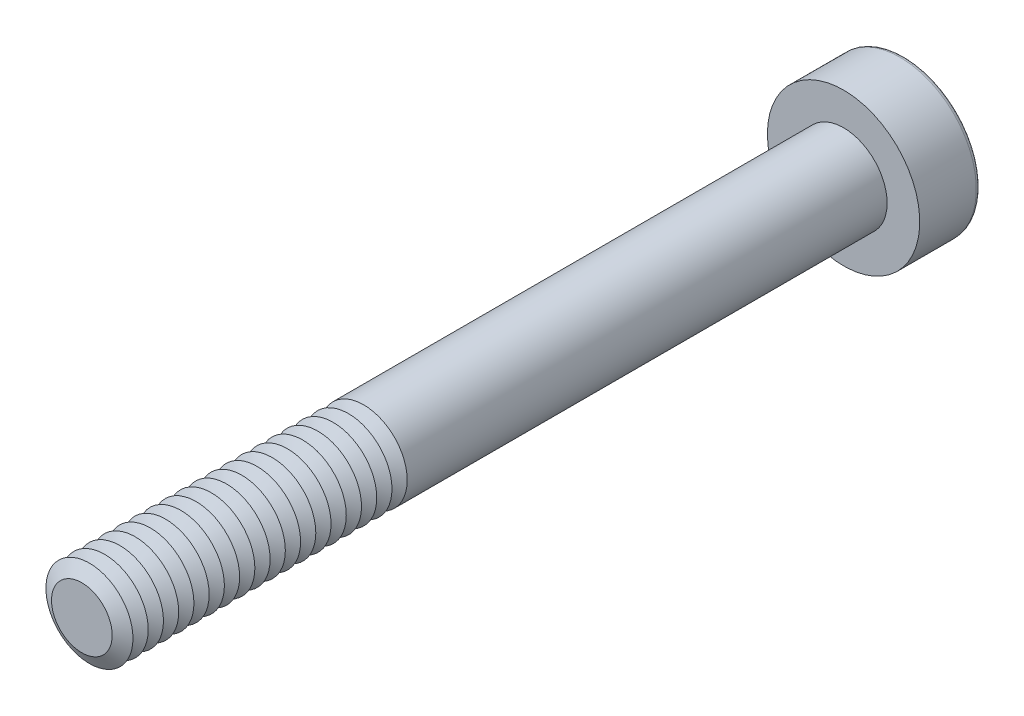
ISO-10303-21;
HEADER;
FILE_DESCRIPTION(('STEP AP214'),'2;1');
FILE_NAME('part.step','',(''),(''),'','','');
FILE_SCHEMA(('AUTOMOTIVE_DESIGN { 1 0 10303 214 1 1 1 1 }'));
ENDSEC;
DATA;
#1=APPLICATION_CONTEXT('core data for automotive mechanical design processes');
#2=APPLICATION_PROTOCOL_DEFINITION('international standard','automotive_design',2000,#1);
#3=PRODUCT_CONTEXT('',#1,'mechanical');
#4=PRODUCT('Part','Part','',(#3));
#5=PRODUCT_RELATED_PRODUCT_CATEGORY('part','',(#4));
#6=PRODUCT_DEFINITION_FORMATION('','',#4);
#7=PRODUCT_DEFINITION_CONTEXT('part definition',#1,'design');
#8=PRODUCT_DEFINITION('design','',#6,#7);
#9=PRODUCT_DEFINITION_SHAPE('','',#8);
#10=(LENGTH_UNIT() NAMED_UNIT(*) SI_UNIT(.MILLI.,.METRE.));
#11=(NAMED_UNIT(*) PLANE_ANGLE_UNIT() SI_UNIT($,.RADIAN.));
#12=(NAMED_UNIT(*) SI_UNIT($,.STERADIAN.) SOLID_ANGLE_UNIT());
#13=UNCERTAINTY_MEASURE_WITH_UNIT(LENGTH_MEASURE(1.E-05),#10,'distance_accuracy_value','');
#14=(GEOMETRIC_REPRESENTATION_CONTEXT(3) GLOBAL_UNCERTAINTY_ASSIGNED_CONTEXT((#13)) GLOBAL_UNIT_ASSIGNED_CONTEXT((#10,
#11,#12)) REPRESENTATION_CONTEXT('',''));
#15=CARTESIAN_POINT('',(0.,0.,0.));
#16=DIRECTION('',(0.,0.,1.));
#17=DIRECTION('',(1.,0.,0.));
#18=AXIS2_PLACEMENT_3D('',#15,#16,#17);
#19=CARTESIAN_POINT('',(0.,0.,32.55));
#20=DIRECTION('',(0.,0.,1.));
#21=DIRECTION('',(1.,0.,0.));
#22=AXIS2_PLACEMENT_3D('',#19,#20,#21);
#23=CONICAL_SURFACE('',#22,2.,1.04719755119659);
#24=CARTESIAN_POINT('',(0.,0.,32.2));
#25=DIRECTION('',(0.,0.,1.));
#26=DIRECTION('',(1.,0.,0.));
#27=AXIS2_PLACEMENT_3D('',#24,#25,#26);
#28=CIRCLE('',#27,1.39378221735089);
#29=CARTESIAN_POINT('',(1.39378221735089,0.,32.2));
#30=VERTEX_POINT('',#29);
#31=EDGE_CURVE('E313',#30,#30,#28,.T.);
#32=ORIENTED_EDGE('',*,*,#31,.T.);
#33=EDGE_LOOP('',(#32));
#34=FACE_BOUND('',#33,.T.);
#35=CARTESIAN_POINT('',(0.,0.,32.55));
#36=DIRECTION('',(0.,0.,1.));
#37=DIRECTION('',(1.,0.,0.));
#38=AXIS2_PLACEMENT_3D('',#35,#36,#37);
#39=CIRCLE('',#38,2.);
#40=CARTESIAN_POINT('',(2.,0.,32.55));
#41=VERTEX_POINT('',#40);
#42=EDGE_CURVE('E316',#41,#41,#39,.T.);
#43=ORIENTED_EDGE('',*,*,#42,.F.);
#44=EDGE_LOOP('',(#43));
#45=FACE_BOUND('',#44,.T.);
#46=ADVANCED_FACE('F39',(#34,#45),#23,.T.);
#47=CARTESIAN_POINT('',(0.,0.,32.2));
#48=DIRECTION('',(0.,0.,-1.));
#49=DIRECTION('',(-1.,0.,0.));
#50=AXIS2_PLACEMENT_3D('',#47,#48,#49);
#51=CONICAL_SURFACE('',#50,1.39378221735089,1.04719755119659);
#52=CARTESIAN_POINT('',(0.,0.,31.85));
#53=DIRECTION('',(0.,0.,1.));
#54=DIRECTION('',(1.,0.,0.));
#55=AXIS2_PLACEMENT_3D('',#52,#53,#54);
#56=CIRCLE('',#55,2.);
#57=CARTESIAN_POINT('',(2.,0.,31.85));
#58=VERTEX_POINT('',#57);
#59=EDGE_CURVE('E324',#58,#58,#56,.T.);
#60=ORIENTED_EDGE('',*,*,#59,.T.);
#61=EDGE_LOOP('',(#60));
#62=FACE_BOUND('',#61,.T.);
#63=ORIENTED_EDGE('',*,*,#31,.F.);
#64=EDGE_LOOP('',(#63));
#65=FACE_BOUND('',#64,.T.);
#66=ADVANCED_FACE('F245',(#62,#65),#51,.T.);
#67=CARTESIAN_POINT('',(0.,0.,35.));
#68=DIRECTION('',(0.,0.,1.));
#69=DIRECTION('',(1.,0.,0.));
#70=AXIS2_PLACEMENT_3D('',#67,#68,#69);
#71=PLANE('',#70);
#72=CARTESIAN_POINT('',(0.,0.,35.));
#73=DIRECTION('',(0.,0.,1.));
#74=DIRECTION('',(1.,0.,0.));
#75=AXIS2_PLACEMENT_3D('',#72,#73,#74);
#76=CIRCLE('',#75,1.39378221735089);
#77=CARTESIAN_POINT('',(1.39378221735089,0.,35.));
#78=VERTEX_POINT('',#77);
#79=EDGE_CURVE('E174',#78,#78,#76,.T.);
#80=ORIENTED_EDGE('',*,*,#79,.T.);
#81=EDGE_LOOP('',(#80));
#82=FACE_BOUND('',#81,.T.);
#83=ADVANCED_FACE('F251',(#82),#71,.T.);
#84=CARTESIAN_POINT('',(0.,0.,35.));
#85=DIRECTION('',(0.,0.,-1.));
#86=DIRECTION('',(-1.,0.,0.));
#87=AXIS2_PLACEMENT_3D('',#84,#85,#86);
#88=CONICAL_SURFACE('',#87,1.39378221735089,1.04719755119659);
#89=CARTESIAN_POINT('',(0.,0.,34.65));
#90=DIRECTION('',(0.,0.,1.));
#91=DIRECTION('',(1.,0.,0.));
#92=AXIS2_PLACEMENT_3D('',#89,#90,#91);
#93=CIRCLE('',#92,2.);
#94=CARTESIAN_POINT('',(2.,0.,34.65));
#95=VERTEX_POINT('',#94);
#96=EDGE_CURVE('E291',#95,#95,#93,.T.);
#97=ORIENTED_EDGE('',*,*,#96,.T.);
#98=EDGE_LOOP('',(#97));
#99=FACE_BOUND('',#98,.T.);
#100=ORIENTED_EDGE('',*,*,#79,.F.);
#101=EDGE_LOOP('',(#100));
#102=FACE_BOUND('',#101,.T.);
#103=ADVANCED_FACE('F199',(#99,#102),#88,.T.);
#104=CARTESIAN_POINT('',(0.,0.,34.65));
#105=DIRECTION('',(0.,0.,1.));
#106=DIRECTION('',(1.,0.,0.));
#107=AXIS2_PLACEMENT_3D('',#104,#105,#106);
#108=CONICAL_SURFACE('',#107,2.,1.04719755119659);
#109=CARTESIAN_POINT('',(0.,0.,34.3));
#110=DIRECTION('',(0.,0.,1.));
#111=DIRECTION('',(1.,0.,0.));
#112=AXIS2_PLACEMENT_3D('',#109,#110,#111);
#113=CIRCLE('',#112,1.39378221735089);
#114=CARTESIAN_POINT('',(1.39378221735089,0.,34.3));
#115=VERTEX_POINT('',#114);
#116=EDGE_CURVE('E288',#115,#115,#113,.T.);
#117=ORIENTED_EDGE('',*,*,#116,.T.);
#118=EDGE_LOOP('',(#117));
#119=FACE_BOUND('',#118,.T.);
#120=ORIENTED_EDGE('',*,*,#96,.F.);
#121=EDGE_LOOP('',(#120));
#122=FACE_BOUND('',#121,.T.);
#123=ADVANCED_FACE('F277',(#119,#122),#108,.T.);
#124=CARTESIAN_POINT('',(0.,0.,34.3));
#125=DIRECTION('',(0.,0.,-1.));
#126=DIRECTION('',(-1.,0.,0.));
#127=AXIS2_PLACEMENT_3D('',#124,#125,#126);
#128=CONICAL_SURFACE('',#127,1.39378221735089,1.04719755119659);
#129=CARTESIAN_POINT('',(0.,0.,33.95));
#130=DIRECTION('',(0.,0.,1.));
#131=DIRECTION('',(1.,0.,0.));
#132=AXIS2_PLACEMENT_3D('',#129,#130,#131);
#133=CIRCLE('',#132,2.);
#134=CARTESIAN_POINT('',(2.,0.,33.95));
#135=VERTEX_POINT('',#134);
#136=EDGE_CURVE('E300',#135,#135,#133,.T.);
#137=ORIENTED_EDGE('',*,*,#136,.T.);
#138=EDGE_LOOP('',(#137));
#139=FACE_BOUND('',#138,.T.);
#140=ORIENTED_EDGE('',*,*,#116,.F.);
#141=EDGE_LOOP('',(#140));
#142=FACE_BOUND('',#141,.T.);
#143=ADVANCED_FACE('F274',(#139,#142),#128,.T.);
#144=CARTESIAN_POINT('',(0.,0.,33.95));
#145=DIRECTION('',(0.,0.,1.));
#146=DIRECTION('',(1.,0.,0.));
#147=AXIS2_PLACEMENT_3D('',#144,#145,#146);
#148=CONICAL_SURFACE('',#147,2.,1.04719755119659);
#149=CARTESIAN_POINT('',(0.,0.,33.6));
#150=DIRECTION('',(0.,0.,1.));
#151=DIRECTION('',(1.,0.,0.));
#152=AXIS2_PLACEMENT_3D('',#149,#150,#151);
#153=CIRCLE('',#152,1.39378221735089);
#154=CARTESIAN_POINT('',(1.39378221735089,0.,33.6));
#155=VERTEX_POINT('',#154);
#156=EDGE_CURVE('E293',#155,#155,#153,.T.);
#157=ORIENTED_EDGE('',*,*,#156,.T.);
#158=EDGE_LOOP('',(#157));
#159=FACE_BOUND('',#158,.T.);
#160=ORIENTED_EDGE('',*,*,#136,.F.);
#161=EDGE_LOOP('',(#160));
#162=FACE_BOUND('',#161,.T.);
#163=ADVANCED_FACE('F270',(#159,#162),#148,.T.);
#164=CARTESIAN_POINT('',(0.,0.,33.6));
#165=DIRECTION('',(0.,0.,-1.));
#166=DIRECTION('',(-1.,0.,0.));
#167=AXIS2_PLACEMENT_3D('',#164,#165,#166);
#168=CONICAL_SURFACE('',#167,1.39378221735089,1.04719755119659);
#169=CARTESIAN_POINT('',(0.,0.,33.25));
#170=DIRECTION('',(0.,0.,1.));
#171=DIRECTION('',(1.,0.,0.));
#172=AXIS2_PLACEMENT_3D('',#169,#170,#171);
#173=CIRCLE('',#172,2.);
#174=CARTESIAN_POINT('',(2.,0.,33.25));
#175=VERTEX_POINT('',#174);
#176=EDGE_CURVE('E310',#175,#175,#173,.T.);
#177=ORIENTED_EDGE('',*,*,#176,.T.);
#178=EDGE_LOOP('',(#177));
#179=FACE_BOUND('',#178,.T.);
#180=ORIENTED_EDGE('',*,*,#156,.F.);
#181=EDGE_LOOP('',(#180));
#182=FACE_BOUND('',#181,.T.);
#183=ADVANCED_FACE('F266',(#179,#182),#168,.T.);
#184=CARTESIAN_POINT('',(0.,0.,33.25));
#185=DIRECTION('',(0.,0.,1.));
#186=DIRECTION('',(1.,0.,0.));
#187=AXIS2_PLACEMENT_3D('',#184,#185,#186);
#188=CONICAL_SURFACE('',#187,2.,1.04719755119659);
#189=CARTESIAN_POINT('',(0.,0.,32.9));
#190=DIRECTION('',(0.,0.,1.));
#191=DIRECTION('',(1.,0.,0.));
#192=AXIS2_PLACEMENT_3D('',#189,#190,#191);
#193=CIRCLE('',#192,1.39378221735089);
#194=CARTESIAN_POINT('',(1.39378221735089,0.,32.9));
#195=VERTEX_POINT('',#194);
#196=EDGE_CURVE('E306',#195,#195,#193,.T.);
#197=ORIENTED_EDGE('',*,*,#196,.T.);
#198=EDGE_LOOP('',(#197));
#199=FACE_BOUND('',#198,.T.);
#200=ORIENTED_EDGE('',*,*,#176,.F.);
#201=EDGE_LOOP('',(#200));
#202=FACE_BOUND('',#201,.T.);
#203=ADVANCED_FACE('F262',(#199,#202),#188,.T.);
#204=CARTESIAN_POINT('',(0.,0.,32.9));
#205=DIRECTION('',(0.,0.,-1.));
#206=DIRECTION('',(-1.,0.,0.));
#207=AXIS2_PLACEMENT_3D('',#204,#205,#206);
#208=CONICAL_SURFACE('',#207,1.39378221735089,1.04719755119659);
#209=ORIENTED_EDGE('',*,*,#42,.T.);
#210=EDGE_LOOP('',(#209));
#211=FACE_BOUND('',#210,.T.);
#212=ORIENTED_EDGE('',*,*,#196,.F.);
#213=EDGE_LOOP('',(#212));
#214=FACE_BOUND('',#213,.T.);
#215=ADVANCED_FACE('F258',(#211,#214),#208,.T.);
#216=CARTESIAN_POINT('',(0.,0.,31.85));
#217=DIRECTION('',(0.,0.,1.));
#218=DIRECTION('',(1.,0.,0.));
#219=AXIS2_PLACEMENT_3D('',#216,#217,#218);
#220=CONICAL_SURFACE('',#219,2.,1.04719755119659);
#221=CARTESIAN_POINT('',(0.,0.,31.5));
#222=DIRECTION('',(0.,0.,1.));
#223=DIRECTION('',(1.,0.,0.));
#224=AXIS2_PLACEMENT_3D('',#221,#222,#223);
#225=CIRCLE('',#224,1.39378221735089);
#226=CARTESIAN_POINT('',(1.39378221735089,0.,31.5));
#227=VERTEX_POINT('',#226);
#228=EDGE_CURVE('E320',#227,#227,#225,.T.);
#229=ORIENTED_EDGE('',*,*,#228,.T.);
#230=EDGE_LOOP('',(#229));
#231=FACE_BOUND('',#230,.T.);
#232=ORIENTED_EDGE('',*,*,#59,.F.);
#233=EDGE_LOOP('',(#232));
#234=FACE_BOUND('',#233,.T.);
#235=ADVANCED_FACE('F261',(#231,#234),#220,.T.);
#236=CARTESIAN_POINT('',(0.,0.,31.5));
#237=DIRECTION('',(0.,0.,-1.));
#238=DIRECTION('',(-1.,0.,0.));
#239=AXIS2_PLACEMENT_3D('',#236,#237,#238);
#240=CONICAL_SURFACE('',#239,1.39378221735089,1.04719755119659);
#241=CARTESIAN_POINT('',(0.,0.,31.15));
#242=DIRECTION('',(0.,0.,1.));
#243=DIRECTION('',(1.,0.,0.));
#244=AXIS2_PLACEMENT_3D('',#241,#242,#243);
#245=CIRCLE('',#244,2.);
#246=CARTESIAN_POINT('',(2.,0.,31.15));
#247=VERTEX_POINT('',#246);
#248=EDGE_CURVE('E332',#247,#247,#245,.T.);
#249=ORIENTED_EDGE('',*,*,#248,.T.);
#250=EDGE_LOOP('',(#249));
#251=FACE_BOUND('',#250,.T.);
#252=ORIENTED_EDGE('',*,*,#228,.F.);
#253=EDGE_LOOP('',(#252));
#254=FACE_BOUND('',#253,.T.);
#255=ADVANCED_FACE('F544',(#251,#254),#240,.T.);
#256=CARTESIAN_POINT('',(0.,0.,31.15));
#257=DIRECTION('',(0.,0.,1.));
#258=DIRECTION('',(1.,0.,0.));
#259=AXIS2_PLACEMENT_3D('',#256,#257,#258);
#260=CONICAL_SURFACE('',#259,2.,1.04719755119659);
#261=CARTESIAN_POINT('',(0.,0.,30.8));
#262=DIRECTION('',(0.,0.,1.));
#263=DIRECTION('',(1.,0.,0.));
#264=AXIS2_PLACEMENT_3D('',#261,#262,#263);
#265=CIRCLE('',#264,1.39378221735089);
#266=CARTESIAN_POINT('',(1.39378221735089,0.,30.8));
#267=VERTEX_POINT('',#266);
#268=EDGE_CURVE('E328',#267,#267,#265,.T.);
#269=ORIENTED_EDGE('',*,*,#268,.T.);
#270=EDGE_LOOP('',(#269));
#271=FACE_BOUND('',#270,.T.);
#272=ORIENTED_EDGE('',*,*,#248,.F.);
#273=EDGE_LOOP('',(#272));
#274=FACE_BOUND('',#273,.T.);
#275=ADVANCED_FACE('F540',(#271,#274),#260,.T.);
#276=CARTESIAN_POINT('',(0.,0.,30.8));
#277=DIRECTION('',(0.,0.,-1.));
#278=DIRECTION('',(-1.,0.,0.));
#279=AXIS2_PLACEMENT_3D('',#276,#277,#278);
#280=CONICAL_SURFACE('',#279,1.39378221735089,1.04719755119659);
#281=CARTESIAN_POINT('',(0.,0.,30.45));
#282=DIRECTION('',(0.,0.,1.));
#283=DIRECTION('',(1.,0.,0.));
#284=AXIS2_PLACEMENT_3D('',#281,#282,#283);
#285=CIRCLE('',#284,2.);
#286=CARTESIAN_POINT('',(2.,0.,30.45));
#287=VERTEX_POINT('',#286);
#288=EDGE_CURVE('E340',#287,#287,#285,.T.);
#289=ORIENTED_EDGE('',*,*,#288,.T.);
#290=EDGE_LOOP('',(#289));
#291=FACE_BOUND('',#290,.T.);
#292=ORIENTED_EDGE('',*,*,#268,.F.);
#293=EDGE_LOOP('',(#292));
#294=FACE_BOUND('',#293,.T.);
#295=ADVANCED_FACE('F536',(#291,#294),#280,.T.);
#296=CARTESIAN_POINT('',(0.,0.,30.45));
#297=DIRECTION('',(0.,0.,1.));
#298=DIRECTION('',(1.,0.,0.));
#299=AXIS2_PLACEMENT_3D('',#296,#297,#298);
#300=CONICAL_SURFACE('',#299,2.,1.04719755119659);
#301=CARTESIAN_POINT('',(0.,0.,30.1));
#302=DIRECTION('',(0.,0.,1.));
#303=DIRECTION('',(1.,0.,0.));
#304=AXIS2_PLACEMENT_3D('',#301,#302,#303);
#305=CIRCLE('',#304,1.39378221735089);
#306=CARTESIAN_POINT('',(1.39378221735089,0.,30.1));
#307=VERTEX_POINT('',#306);
#308=EDGE_CURVE('E336',#307,#307,#305,.T.);
#309=ORIENTED_EDGE('',*,*,#308,.T.);
#310=EDGE_LOOP('',(#309));
#311=FACE_BOUND('',#310,.T.);
#312=ORIENTED_EDGE('',*,*,#288,.F.);
#313=EDGE_LOOP('',(#312));
#314=FACE_BOUND('',#313,.T.);
#315=ADVANCED_FACE('F532',(#311,#314),#300,.T.);
#316=CARTESIAN_POINT('',(0.,0.,30.1));
#317=DIRECTION('',(0.,0.,-1.));
#318=DIRECTION('',(-1.,0.,0.));
#319=AXIS2_PLACEMENT_3D('',#316,#317,#318);
#320=CONICAL_SURFACE('',#319,1.39378221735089,1.04719755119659);
#321=CARTESIAN_POINT('',(0.,0.,29.75));
#322=DIRECTION('',(0.,0.,1.));
#323=DIRECTION('',(1.,0.,0.));
#324=AXIS2_PLACEMENT_3D('',#321,#322,#323);
#325=CIRCLE('',#324,2.);
#326=CARTESIAN_POINT('',(2.,0.,29.75));
#327=VERTEX_POINT('',#326);
#328=EDGE_CURVE('E348',#327,#327,#325,.T.);
#329=ORIENTED_EDGE('',*,*,#328,.T.);
#330=EDGE_LOOP('',(#329));
#331=FACE_BOUND('',#330,.T.);
#332=ORIENTED_EDGE('',*,*,#308,.F.);
#333=EDGE_LOOP('',(#332));
#334=FACE_BOUND('',#333,.T.);
#335=ADVANCED_FACE('F528',(#331,#334),#320,.T.);
#336=CARTESIAN_POINT('',(0.,0.,29.75));
#337=DIRECTION('',(0.,0.,1.));
#338=DIRECTION('',(1.,0.,0.));
#339=AXIS2_PLACEMENT_3D('',#336,#337,#338);
#340=CONICAL_SURFACE('',#339,2.,1.04719755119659);
#341=CARTESIAN_POINT('',(0.,0.,29.4));
#342=DIRECTION('',(0.,0.,1.));
#343=DIRECTION('',(1.,0.,0.));
#344=AXIS2_PLACEMENT_3D('',#341,#342,#343);
#345=CIRCLE('',#344,1.39378221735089);
#346=CARTESIAN_POINT('',(1.39378221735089,0.,29.4));
#347=VERTEX_POINT('',#346);
#348=EDGE_CURVE('E344',#347,#347,#345,.T.);
#349=ORIENTED_EDGE('',*,*,#348,.T.);
#350=EDGE_LOOP('',(#349));
#351=FACE_BOUND('',#350,.T.);
#352=ORIENTED_EDGE('',*,*,#328,.F.);
#353=EDGE_LOOP('',(#352));
#354=FACE_BOUND('',#353,.T.);
#355=ADVANCED_FACE('F524',(#351,#354),#340,.T.);
#356=CARTESIAN_POINT('',(0.,0.,29.4));
#357=DIRECTION('',(0.,0.,-1.));
#358=DIRECTION('',(-1.,0.,0.));
#359=AXIS2_PLACEMENT_3D('',#356,#357,#358);
#360=CONICAL_SURFACE('',#359,1.39378221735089,1.04719755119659);
#361=CARTESIAN_POINT('',(0.,0.,29.05));
#362=DIRECTION('',(0.,0.,1.));
#363=DIRECTION('',(1.,0.,0.));
#364=AXIS2_PLACEMENT_3D('',#361,#362,#363);
#365=CIRCLE('',#364,2.);
#366=CARTESIAN_POINT('',(2.,0.,29.05));
#367=VERTEX_POINT('',#366);
#368=EDGE_CURVE('E355',#367,#367,#365,.T.);
#369=ORIENTED_EDGE('',*,*,#368,.T.);
#370=EDGE_LOOP('',(#369));
#371=FACE_BOUND('',#370,.T.);
#372=ORIENTED_EDGE('',*,*,#348,.F.);
#373=EDGE_LOOP('',(#372));
#374=FACE_BOUND('',#373,.T.);
#375=ADVANCED_FACE('F520',(#371,#374),#360,.T.);
#376=CARTESIAN_POINT('',(0.,0.,29.05));
#377=DIRECTION('',(0.,0.,1.));
#378=DIRECTION('',(1.,0.,0.));
#379=AXIS2_PLACEMENT_3D('',#376,#377,#378);
#380=CONICAL_SURFACE('',#379,2.,1.04719755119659);
#381=CARTESIAN_POINT('',(0.,0.,28.7));
#382=DIRECTION('',(0.,0.,1.));
#383=DIRECTION('',(1.,0.,0.));
#384=AXIS2_PLACEMENT_3D('',#381,#382,#383);
#385=CIRCLE('',#384,1.39378221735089);
#386=CARTESIAN_POINT('',(1.39378221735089,0.,28.7));
#387=VERTEX_POINT('',#386);
#388=EDGE_CURVE('E351',#387,#387,#385,.T.);
#389=ORIENTED_EDGE('',*,*,#388,.T.);
#390=EDGE_LOOP('',(#389));
#391=FACE_BOUND('',#390,.T.);
#392=ORIENTED_EDGE('',*,*,#368,.F.);
#393=EDGE_LOOP('',(#392));
#394=FACE_BOUND('',#393,.T.);
#395=ADVANCED_FACE('F516',(#391,#394),#380,.T.);
#396=CARTESIAN_POINT('',(0.,0.,28.7));
#397=DIRECTION('',(0.,0.,-1.));
#398=DIRECTION('',(-1.,0.,0.));
#399=AXIS2_PLACEMENT_3D('',#396,#397,#398);
#400=CONICAL_SURFACE('',#399,1.39378221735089,1.04719755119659);
#401=CARTESIAN_POINT('',(0.,0.,28.35));
#402=DIRECTION('',(0.,0.,1.));
#403=DIRECTION('',(1.,0.,0.));
#404=AXIS2_PLACEMENT_3D('',#401,#402,#403);
#405=CIRCLE('',#404,2.);
#406=CARTESIAN_POINT('',(2.,0.,28.35));
#407=VERTEX_POINT('',#406);
#408=EDGE_CURVE('E363',#407,#407,#405,.T.);
#409=ORIENTED_EDGE('',*,*,#408,.T.);
#410=EDGE_LOOP('',(#409));
#411=FACE_BOUND('',#410,.T.);
#412=ORIENTED_EDGE('',*,*,#388,.F.);
#413=EDGE_LOOP('',(#412));
#414=FACE_BOUND('',#413,.T.);
#415=ADVANCED_FACE('F512',(#411,#414),#400,.T.);
#416=CARTESIAN_POINT('',(0.,0.,28.35));
#417=DIRECTION('',(0.,0.,1.));
#418=DIRECTION('',(1.,0.,0.));
#419=AXIS2_PLACEMENT_3D('',#416,#417,#418);
#420=CONICAL_SURFACE('',#419,2.,1.04719755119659);
#421=CARTESIAN_POINT('',(0.,0.,28.));
#422=DIRECTION('',(0.,0.,1.));
#423=DIRECTION('',(1.,0.,0.));
#424=AXIS2_PLACEMENT_3D('',#421,#422,#423);
#425=CIRCLE('',#424,1.39378221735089);
#426=CARTESIAN_POINT('',(1.39378221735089,0.,28.));
#427=VERTEX_POINT('',#426);
#428=EDGE_CURVE('E359',#427,#427,#425,.T.);
#429=ORIENTED_EDGE('',*,*,#428,.T.);
#430=EDGE_LOOP('',(#429));
#431=FACE_BOUND('',#430,.T.);
#432=ORIENTED_EDGE('',*,*,#408,.F.);
#433=EDGE_LOOP('',(#432));
#434=FACE_BOUND('',#433,.T.);
#435=ADVANCED_FACE('F508',(#431,#434),#420,.T.);
#436=CARTESIAN_POINT('',(0.,0.,28.));
#437=DIRECTION('',(0.,0.,-1.));
#438=DIRECTION('',(-1.,0.,0.));
#439=AXIS2_PLACEMENT_3D('',#436,#437,#438);
#440=CONICAL_SURFACE('',#439,1.39378221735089,1.04719755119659);
#441=CARTESIAN_POINT('',(0.,0.,27.65));
#442=DIRECTION('',(0.,0.,1.));
#443=DIRECTION('',(1.,0.,0.));
#444=AXIS2_PLACEMENT_3D('',#441,#442,#443);
#445=CIRCLE('',#444,2.);
#446=CARTESIAN_POINT('',(2.,0.,27.65));
#447=VERTEX_POINT('',#446);
#448=EDGE_CURVE('E371',#447,#447,#445,.T.);
#449=ORIENTED_EDGE('',*,*,#448,.T.);
#450=EDGE_LOOP('',(#449));
#451=FACE_BOUND('',#450,.T.);
#452=ORIENTED_EDGE('',*,*,#428,.F.);
#453=EDGE_LOOP('',(#452));
#454=FACE_BOUND('',#453,.T.);
#455=ADVANCED_FACE('F504',(#451,#454),#440,.T.);
#456=CARTESIAN_POINT('',(0.,0.,27.65));
#457=DIRECTION('',(0.,0.,1.));
#458=DIRECTION('',(1.,0.,0.));
#459=AXIS2_PLACEMENT_3D('',#456,#457,#458);
#460=CONICAL_SURFACE('',#459,2.,1.04719755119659);
#461=CARTESIAN_POINT('',(0.,0.,27.3));
#462=DIRECTION('',(0.,0.,1.));
#463=DIRECTION('',(1.,0.,0.));
#464=AXIS2_PLACEMENT_3D('',#461,#462,#463);
#465=CIRCLE('',#464,1.39378221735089);
#466=CARTESIAN_POINT('',(1.39378221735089,0.,27.3));
#467=VERTEX_POINT('',#466);
#468=EDGE_CURVE('E367',#467,#467,#465,.T.);
#469=ORIENTED_EDGE('',*,*,#468,.T.);
#470=EDGE_LOOP('',(#469));
#471=FACE_BOUND('',#470,.T.);
#472=ORIENTED_EDGE('',*,*,#448,.F.);
#473=EDGE_LOOP('',(#472));
#474=FACE_BOUND('',#473,.T.);
#475=ADVANCED_FACE('F500',(#471,#474),#460,.T.);
#476=CARTESIAN_POINT('',(0.,0.,27.3));
#477=DIRECTION('',(0.,0.,-1.));
#478=DIRECTION('',(-1.,0.,0.));
#479=AXIS2_PLACEMENT_3D('',#476,#477,#478);
#480=CONICAL_SURFACE('',#479,1.39378221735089,1.04719755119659);
#481=CARTESIAN_POINT('',(0.,0.,26.95));
#482=DIRECTION('',(0.,0.,1.));
#483=DIRECTION('',(1.,0.,0.));
#484=AXIS2_PLACEMENT_3D('',#481,#482,#483);
#485=CIRCLE('',#484,2.);
#486=CARTESIAN_POINT('',(2.,0.,26.95));
#487=VERTEX_POINT('',#486);
#488=EDGE_CURVE('E379',#487,#487,#485,.T.);
#489=ORIENTED_EDGE('',*,*,#488,.T.);
#490=EDGE_LOOP('',(#489));
#491=FACE_BOUND('',#490,.T.);
#492=ORIENTED_EDGE('',*,*,#468,.F.);
#493=EDGE_LOOP('',(#492));
#494=FACE_BOUND('',#493,.T.);
#495=ADVANCED_FACE('F496',(#491,#494),#480,.T.);
#496=CARTESIAN_POINT('',(0.,0.,26.95));
#497=DIRECTION('',(0.,0.,1.));
#498=DIRECTION('',(1.,0.,0.));
#499=AXIS2_PLACEMENT_3D('',#496,#497,#498);
#500=CONICAL_SURFACE('',#499,2.,1.04719755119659);
#501=CARTESIAN_POINT('',(0.,0.,26.6));
#502=DIRECTION('',(0.,0.,1.));
#503=DIRECTION('',(1.,0.,0.));
#504=AXIS2_PLACEMENT_3D('',#501,#502,#503);
#505=CIRCLE('',#504,1.39378221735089);
#506=CARTESIAN_POINT('',(1.39378221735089,0.,26.6));
#507=VERTEX_POINT('',#506);
#508=EDGE_CURVE('E375',#507,#507,#505,.T.);
#509=ORIENTED_EDGE('',*,*,#508,.T.);
#510=EDGE_LOOP('',(#509));
#511=FACE_BOUND('',#510,.T.);
#512=ORIENTED_EDGE('',*,*,#488,.F.);
#513=EDGE_LOOP('',(#512));
#514=FACE_BOUND('',#513,.T.);
#515=ADVANCED_FACE('F492',(#511,#514),#500,.T.);
#516=CARTESIAN_POINT('',(0.,0.,26.6));
#517=DIRECTION('',(0.,0.,-1.));
#518=DIRECTION('',(-1.,0.,0.));
#519=AXIS2_PLACEMENT_3D('',#516,#517,#518);
#520=CONICAL_SURFACE('',#519,1.39378221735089,1.04719755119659);
#521=CARTESIAN_POINT('',(0.,0.,26.25));
#522=DIRECTION('',(0.,0.,1.));
#523=DIRECTION('',(1.,0.,0.));
#524=AXIS2_PLACEMENT_3D('',#521,#522,#523);
#525=CIRCLE('',#524,2.);
#526=CARTESIAN_POINT('',(2.,0.,26.25));
#527=VERTEX_POINT('',#526);
#528=EDGE_CURVE('E387',#527,#527,#525,.T.);
#529=ORIENTED_EDGE('',*,*,#528,.T.);
#530=EDGE_LOOP('',(#529));
#531=FACE_BOUND('',#530,.T.);
#532=ORIENTED_EDGE('',*,*,#508,.F.);
#533=EDGE_LOOP('',(#532));
#534=FACE_BOUND('',#533,.T.);
#535=ADVANCED_FACE('F488',(#531,#534),#520,.T.);
#536=CARTESIAN_POINT('',(0.,0.,26.25));
#537=DIRECTION('',(0.,0.,1.));
#538=DIRECTION('',(1.,0.,0.));
#539=AXIS2_PLACEMENT_3D('',#536,#537,#538);
#540=CONICAL_SURFACE('',#539,2.,1.04719755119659);
#541=CARTESIAN_POINT('',(0.,0.,25.9));
#542=DIRECTION('',(0.,0.,1.));
#543=DIRECTION('',(1.,0.,0.));
#544=AXIS2_PLACEMENT_3D('',#541,#542,#543);
#545=CIRCLE('',#544,1.39378221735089);
#546=CARTESIAN_POINT('',(1.39378221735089,0.,25.9));
#547=VERTEX_POINT('',#546);
#548=EDGE_CURVE('E383',#547,#547,#545,.T.);
#549=ORIENTED_EDGE('',*,*,#548,.T.);
#550=EDGE_LOOP('',(#549));
#551=FACE_BOUND('',#550,.T.);
#552=ORIENTED_EDGE('',*,*,#528,.F.);
#553=EDGE_LOOP('',(#552));
#554=FACE_BOUND('',#553,.T.);
#555=ADVANCED_FACE('F484',(#551,#554),#540,.T.);
#556=CARTESIAN_POINT('',(0.,0.,25.9));
#557=DIRECTION('',(0.,0.,-1.));
#558=DIRECTION('',(-1.,0.,0.));
#559=AXIS2_PLACEMENT_3D('',#556,#557,#558);
#560=CONICAL_SURFACE('',#559,1.39378221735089,1.04719755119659);
#561=CARTESIAN_POINT('',(0.,0.,25.55));
#562=DIRECTION('',(0.,0.,1.));
#563=DIRECTION('',(1.,0.,0.));
#564=AXIS2_PLACEMENT_3D('',#561,#562,#563);
#565=CIRCLE('',#564,2.);
#566=CARTESIAN_POINT('',(2.,0.,25.55));
#567=VERTEX_POINT('',#566);
#568=EDGE_CURVE('E395',#567,#567,#565,.T.);
#569=ORIENTED_EDGE('',*,*,#568,.T.);
#570=EDGE_LOOP('',(#569));
#571=FACE_BOUND('',#570,.T.);
#572=ORIENTED_EDGE('',*,*,#548,.F.);
#573=EDGE_LOOP('',(#572));
#574=FACE_BOUND('',#573,.T.);
#575=ADVANCED_FACE('F480',(#571,#574),#560,.T.);
#576=CARTESIAN_POINT('',(0.,0.,25.55));
#577=DIRECTION('',(0.,0.,1.));
#578=DIRECTION('',(1.,0.,0.));
#579=AXIS2_PLACEMENT_3D('',#576,#577,#578);
#580=CONICAL_SURFACE('',#579,2.,1.04719755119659);
#581=CARTESIAN_POINT('',(0.,0.,25.2));
#582=DIRECTION('',(0.,0.,1.));
#583=DIRECTION('',(1.,0.,0.));
#584=AXIS2_PLACEMENT_3D('',#581,#582,#583);
#585=CIRCLE('',#584,1.39378221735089);
#586=CARTESIAN_POINT('',(1.39378221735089,0.,25.2));
#587=VERTEX_POINT('',#586);
#588=EDGE_CURVE('E391',#587,#587,#585,.T.);
#589=ORIENTED_EDGE('',*,*,#588,.T.);
#590=EDGE_LOOP('',(#589));
#591=FACE_BOUND('',#590,.T.);
#592=ORIENTED_EDGE('',*,*,#568,.F.);
#593=EDGE_LOOP('',(#592));
#594=FACE_BOUND('',#593,.T.);
#595=ADVANCED_FACE('F476',(#591,#594),#580,.T.);
#596=CARTESIAN_POINT('',(0.,0.,25.2));
#597=DIRECTION('',(0.,0.,-1.));
#598=DIRECTION('',(-1.,0.,0.));
#599=AXIS2_PLACEMENT_3D('',#596,#597,#598);
#600=CONICAL_SURFACE('',#599,1.39378221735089,1.04719755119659);
#601=CARTESIAN_POINT('',(0.,0.,24.85));
#602=DIRECTION('',(0.,0.,1.));
#603=DIRECTION('',(1.,0.,0.));
#604=AXIS2_PLACEMENT_3D('',#601,#602,#603);
#605=CIRCLE('',#604,2.);
#606=CARTESIAN_POINT('',(2.,0.,24.85));
#607=VERTEX_POINT('',#606);
#608=EDGE_CURVE('E403',#607,#607,#605,.T.);
#609=ORIENTED_EDGE('',*,*,#608,.T.);
#610=EDGE_LOOP('',(#609));
#611=FACE_BOUND('',#610,.T.);
#612=ORIENTED_EDGE('',*,*,#588,.F.);
#613=EDGE_LOOP('',(#612));
#614=FACE_BOUND('',#613,.T.);
#615=ADVANCED_FACE('F472',(#611,#614),#600,.T.);
#616=CARTESIAN_POINT('',(0.,0.,24.85));
#617=DIRECTION('',(0.,0.,1.));
#618=DIRECTION('',(1.,0.,0.));
#619=AXIS2_PLACEMENT_3D('',#616,#617,#618);
#620=CONICAL_SURFACE('',#619,2.,1.04719755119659);
#621=CARTESIAN_POINT('',(0.,0.,24.5));
#622=DIRECTION('',(0.,0.,1.));
#623=DIRECTION('',(1.,0.,0.));
#624=AXIS2_PLACEMENT_3D('',#621,#622,#623);
#625=CIRCLE('',#624,1.39378221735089);
#626=CARTESIAN_POINT('',(1.39378221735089,0.,24.5));
#627=VERTEX_POINT('',#626);
#628=EDGE_CURVE('E399',#627,#627,#625,.T.);
#629=ORIENTED_EDGE('',*,*,#628,.T.);
#630=EDGE_LOOP('',(#629));
#631=FACE_BOUND('',#630,.T.);
#632=ORIENTED_EDGE('',*,*,#608,.F.);
#633=EDGE_LOOP('',(#632));
#634=FACE_BOUND('',#633,.T.);
#635=ADVANCED_FACE('F468',(#631,#634),#620,.T.);
#636=CARTESIAN_POINT('',(0.,0.,24.5));
#637=DIRECTION('',(0.,0.,-1.));
#638=DIRECTION('',(-1.,0.,0.));
#639=AXIS2_PLACEMENT_3D('',#636,#637,#638);
#640=CONICAL_SURFACE('',#639,1.39378221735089,1.04719755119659);
#641=CARTESIAN_POINT('',(0.,0.,24.15));
#642=DIRECTION('',(0.,0.,1.));
#643=DIRECTION('',(1.,0.,0.));
#644=AXIS2_PLACEMENT_3D('',#641,#642,#643);
#645=CIRCLE('',#644,2.);
#646=CARTESIAN_POINT('',(2.,0.,24.15));
#647=VERTEX_POINT('',#646);
#648=EDGE_CURVE('E411',#647,#647,#645,.T.);
#649=ORIENTED_EDGE('',*,*,#648,.T.);
#650=EDGE_LOOP('',(#649));
#651=FACE_BOUND('',#650,.T.);
#652=ORIENTED_EDGE('',*,*,#628,.F.);
#653=EDGE_LOOP('',(#652));
#654=FACE_BOUND('',#653,.T.);
#655=ADVANCED_FACE('F464',(#651,#654),#640,.T.);
#656=CARTESIAN_POINT('',(0.,0.,24.15));
#657=DIRECTION('',(0.,0.,1.));
#658=DIRECTION('',(1.,0.,0.));
#659=AXIS2_PLACEMENT_3D('',#656,#657,#658);
#660=CONICAL_SURFACE('',#659,2.,1.04719755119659);
#661=CARTESIAN_POINT('',(0.,0.,23.8));
#662=DIRECTION('',(0.,0.,1.));
#663=DIRECTION('',(1.,0.,0.));
#664=AXIS2_PLACEMENT_3D('',#661,#662,#663);
#665=CIRCLE('',#664,1.39378221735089);
#666=CARTESIAN_POINT('',(1.39378221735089,0.,23.8));
#667=VERTEX_POINT('',#666);
#668=EDGE_CURVE('E407',#667,#667,#665,.T.);
#669=ORIENTED_EDGE('',*,*,#668,.T.);
#670=EDGE_LOOP('',(#669));
#671=FACE_BOUND('',#670,.T.);
#672=ORIENTED_EDGE('',*,*,#648,.F.);
#673=EDGE_LOOP('',(#672));
#674=FACE_BOUND('',#673,.T.);
#675=ADVANCED_FACE('F460',(#671,#674),#660,.T.);
#676=CARTESIAN_POINT('',(0.,0.,23.8));
#677=DIRECTION('',(0.,0.,-1.));
#678=DIRECTION('',(-1.,0.,0.));
#679=AXIS2_PLACEMENT_3D('',#676,#677,#678);
#680=CONICAL_SURFACE('',#679,1.39378221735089,1.04719755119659);
#681=CARTESIAN_POINT('',(0.,0.,23.45));
#682=DIRECTION('',(0.,0.,1.));
#683=DIRECTION('',(1.,0.,0.));
#684=AXIS2_PLACEMENT_3D('',#681,#682,#683);
#685=CIRCLE('',#684,2.);
#686=CARTESIAN_POINT('',(2.,0.,23.45));
#687=VERTEX_POINT('',#686);
#688=EDGE_CURVE('E419',#687,#687,#685,.T.);
#689=ORIENTED_EDGE('',*,*,#688,.T.);
#690=EDGE_LOOP('',(#689));
#691=FACE_BOUND('',#690,.T.);
#692=ORIENTED_EDGE('',*,*,#668,.F.);
#693=EDGE_LOOP('',(#692));
#694=FACE_BOUND('',#693,.T.);
#695=ADVANCED_FACE('F456',(#691,#694),#680,.T.);
#696=CARTESIAN_POINT('',(0.,0.,23.45));
#697=DIRECTION('',(0.,0.,1.));
#698=DIRECTION('',(1.,0.,0.));
#699=AXIS2_PLACEMENT_3D('',#696,#697,#698);
#700=CONICAL_SURFACE('',#699,2.,1.04719755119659);
#701=CARTESIAN_POINT('',(0.,0.,23.1));
#702=DIRECTION('',(0.,0.,1.));
#703=DIRECTION('',(1.,0.,0.));
#704=AXIS2_PLACEMENT_3D('',#701,#702,#703);
#705=CIRCLE('',#704,1.39378221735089);
#706=CARTESIAN_POINT('',(1.39378221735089,0.,23.1));
#707=VERTEX_POINT('',#706);
#708=EDGE_CURVE('E415',#707,#707,#705,.T.);
#709=ORIENTED_EDGE('',*,*,#708,.T.);
#710=EDGE_LOOP('',(#709));
#711=FACE_BOUND('',#710,.T.);
#712=ORIENTED_EDGE('',*,*,#688,.F.);
#713=EDGE_LOOP('',(#712));
#714=FACE_BOUND('',#713,.T.);
#715=ADVANCED_FACE('F451',(#711,#714),#700,.T.);
#716=CARTESIAN_POINT('',(0.,0.,23.1));
#717=DIRECTION('',(0.,0.,-1.));
#718=DIRECTION('',(-1.,0.,0.));
#719=AXIS2_PLACEMENT_3D('',#716,#717,#718);
#720=CONICAL_SURFACE('',#719,1.39378221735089,1.04719755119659);
#721=CARTESIAN_POINT('',(0.,0.,22.75));
#722=DIRECTION('',(0.,0.,1.));
#723=DIRECTION('',(1.,0.,0.));
#724=AXIS2_PLACEMENT_3D('',#721,#722,#723);
#725=CIRCLE('',#724,2.);
#726=CARTESIAN_POINT('',(2.,0.,22.75));
#727=VERTEX_POINT('',#726);
#728=EDGE_CURVE('E431',#727,#727,#725,.T.);
#729=ORIENTED_EDGE('',*,*,#728,.T.);
#730=EDGE_LOOP('',(#729));
#731=FACE_BOUND('',#730,.T.);
#732=ORIENTED_EDGE('',*,*,#708,.F.);
#733=EDGE_LOOP('',(#732));
#734=FACE_BOUND('',#733,.T.);
#735=ADVANCED_FACE('F437',(#731,#734),#720,.T.);
#736=CARTESIAN_POINT('',(0.,0.,22.75));
#737=DIRECTION('',(0.,0.,1.));
#738=DIRECTION('',(1.,0.,0.));
#739=AXIS2_PLACEMENT_3D('',#736,#737,#738);
#740=CONICAL_SURFACE('',#739,2.,1.04719755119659);
#741=CARTESIAN_POINT('',(0.,0.,22.4));
#742=DIRECTION('',(0.,0.,1.));
#743=DIRECTION('',(1.,0.,0.));
#744=AXIS2_PLACEMENT_3D('',#741,#742,#743);
#745=CIRCLE('',#744,1.39378221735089);
#746=CARTESIAN_POINT('',(1.39378221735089,0.,22.4));
#747=VERTEX_POINT('',#746);
#748=EDGE_CURVE('E423',#747,#747,#745,.T.);
#749=ORIENTED_EDGE('',*,*,#748,.T.);
#750=EDGE_LOOP('',(#749));
#751=FACE_BOUND('',#750,.T.);
#752=ORIENTED_EDGE('',*,*,#728,.F.);
#753=EDGE_LOOP('',(#752));
#754=FACE_BOUND('',#753,.T.);
#755=ADVANCED_FACE('F440',(#751,#754),#740,.T.);
#756=CARTESIAN_POINT('',(0.,0.,22.4));
#757=DIRECTION('',(0.,0.,-1.));
#758=DIRECTION('',(-1.,0.,0.));
#759=AXIS2_PLACEMENT_3D('',#756,#757,#758);
#760=CONICAL_SURFACE('',#759,1.39378221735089,1.04719755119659);
#761=CARTESIAN_POINT('',(0.,0.,22.05));
#762=DIRECTION('',(0.,0.,1.));
#763=DIRECTION('',(1.,0.,0.));
#764=AXIS2_PLACEMENT_3D('',#761,#762,#763);
#765=CIRCLE('',#764,2.);
#766=CARTESIAN_POINT('',(2.,0.,22.05));
#767=VERTEX_POINT('',#766);
#768=EDGE_CURVE('E427',#767,#767,#765,.T.);
#769=ORIENTED_EDGE('',*,*,#768,.T.);
#770=EDGE_LOOP('',(#769));
#771=FACE_BOUND('',#770,.T.);
#772=ORIENTED_EDGE('',*,*,#748,.F.);
#773=EDGE_LOOP('',(#772));
#774=FACE_BOUND('',#773,.T.);
#775=ADVANCED_FACE('F442',(#771,#774),#760,.T.);
#776=CARTESIAN_POINT('',(0.,0.,-0.925));
#777=DIRECTION('',(0.,0.,-1.));
#778=DIRECTION('',(-1.,0.,0.));
#779=AXIS2_PLACEMENT_3D('',#776,#777,#778);
#780=CONICAL_SURFACE('',#779,1.25,1.0471975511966);
#781=CARTESIAN_POINT('',(0.,0.,-0.203312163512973));
#782=VERTEX_POINT('',#781);
#783=VERTEX_LOOP('',#782);
#784=FACE_BOUND('',#783,.T.);
#785=CARTESIAN_POINT('',(0.,0.,-0.925));
#786=DIRECTION('',(0.,0.,-1.));
#787=DIRECTION('',(-1.,0.,0.));
#788=AXIS2_PLACEMENT_3D('',#785,#786,#787);
#789=CIRCLE('',#788,1.25);
#790=CARTESIAN_POINT('',(-1.08253175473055,0.624999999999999,-0.925));
#791=VERTEX_POINT('',#790);
#792=CARTESIAN_POINT('',(0.,1.25,-0.925));
#793=VERTEX_POINT('',#792);
#794=EDGE_CURVE('E149',#791,#793,#789,.T.);
#795=ORIENTED_EDGE('',*,*,#794,.T.);
#796=CARTESIAN_POINT('',(0.,0.,-0.925));
#797=DIRECTION('',(0.,0.,-1.));
#798=DIRECTION('',(-1.,0.,0.));
#799=AXIS2_PLACEMENT_3D('',#796,#797,#798);
#800=CIRCLE('',#799,1.25);
#801=CARTESIAN_POINT('',(1.08253175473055,0.625,-0.925));
#802=VERTEX_POINT('',#801);
#803=EDGE_CURVE('E54',#793,#802,#800,.T.);
#804=ORIENTED_EDGE('',*,*,#803,.T.);
#805=CARTESIAN_POINT('',(1.08253175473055,-0.624999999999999,-0.925));
#806=VERTEX_POINT('',#805);
#807=EDGE_CURVE('E1087',#802,#806,#800,.T.);
#808=ORIENTED_EDGE('',*,*,#807,.T.);
#809=CARTESIAN_POINT('',(0.,-1.25,-0.925));
#810=VERTEX_POINT('',#809);
#811=EDGE_CURVE('E1085',#806,#810,#800,.T.);
#812=ORIENTED_EDGE('',*,*,#811,.T.);
#813=CARTESIAN_POINT('',(-1.08253175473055,-0.624999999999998,-0.925));
#814=VERTEX_POINT('',#813);
#815=EDGE_CURVE('E1081',#810,#814,#800,.T.);
#816=ORIENTED_EDGE('',*,*,#815,.T.);
#817=EDGE_CURVE('E1079',#814,#791,#800,.T.);
#818=ORIENTED_EDGE('',*,*,#817,.T.);
#819=EDGE_LOOP('',(#795,#804,#808,#812,#816,#818));
#820=FACE_BOUND('',#819,.T.);
#821=ADVANCED_FACE('F201',(#784,#820),#780,.F.);
#822=CARTESIAN_POINT('',(0.,0.,-0.925));
#823=DIRECTION('',(0.,0.,-1.));
#824=DIRECTION('',(-1.,0.,0.));
#825=AXIS2_PLACEMENT_3D('',#822,#823,#824);
#826=PLANE('',#825);
#827=ORIENTED_EDGE('',*,*,#803,.F.);
#828=DIRECTION('',(1.,0.,0.));
#829=VECTOR('',#828,1.);
#830=CARTESIAN_POINT('',(-0.721687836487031,1.25,-0.925));
#831=LINE('',#830,#829);
#832=CARTESIAN_POINT('',(0.721687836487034,1.25,-0.925));
#833=VERTEX_POINT('',#832);
#834=EDGE_CURVE('E1125',#793,#833,#831,.T.);
#835=ORIENTED_EDGE('',*,*,#834,.T.);
#836=DIRECTION('',(0.5,-0.866025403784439,0.));
#837=VECTOR('',#836,1.);
#838=CARTESIAN_POINT('',(0.721687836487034,1.25,-0.925));
#839=LINE('',#838,#837);
#840=EDGE_CURVE('E155',#833,#802,#839,.T.);
#841=ORIENTED_EDGE('',*,*,#840,.T.);
#842=EDGE_LOOP('',(#827,#835,#841));
#843=FACE_BOUND('',#842,.T.);
#844=ADVANCED_FACE('F651',(#843),#826,.T.);
#845=ORIENTED_EDGE('',*,*,#807,.F.);
#846=CARTESIAN_POINT('',(1.44337567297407,0.,-0.925));
#847=VERTEX_POINT('',#846);
#848=EDGE_CURVE('E1127',#802,#847,#839,.T.);
#849=ORIENTED_EDGE('',*,*,#848,.T.);
#850=DIRECTION('',(-0.5,-0.866025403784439,0.));
#851=VECTOR('',#850,1.);
#852=CARTESIAN_POINT('',(1.44337567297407,0.,-0.925));
#853=LINE('',#852,#851);
#854=EDGE_CURVE('E1103',#847,#806,#853,.T.);
#855=ORIENTED_EDGE('',*,*,#854,.T.);
#856=EDGE_LOOP('',(#845,#849,#855));
#857=FACE_BOUND('',#856,.T.);
#858=ADVANCED_FACE('F661',(#857),#826,.T.);
#859=ORIENTED_EDGE('',*,*,#811,.F.);
#860=CARTESIAN_POINT('',(0.721687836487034,-1.25,-0.925));
#861=VERTEX_POINT('',#860);
#862=EDGE_CURVE('E1105',#806,#861,#853,.T.);
#863=ORIENTED_EDGE('',*,*,#862,.T.);
#864=DIRECTION('',(-1.,0.,0.));
#865=VECTOR('',#864,1.);
#866=CARTESIAN_POINT('',(0.721687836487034,-1.25,-0.925));
#867=LINE('',#866,#865);
#868=EDGE_CURVE('E1052',#861,#810,#867,.T.);
#869=ORIENTED_EDGE('',*,*,#868,.T.);
#870=EDGE_LOOP('',(#859,#863,#869));
#871=FACE_BOUND('',#870,.T.);
#872=ADVANCED_FACE('F671',(#871),#826,.T.);
#873=ORIENTED_EDGE('',*,*,#815,.F.);
#874=CARTESIAN_POINT('',(-0.721687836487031,-1.25,-0.925));
#875=VERTEX_POINT('',#874);
#876=EDGE_CURVE('E1099',#810,#875,#867,.T.);
#877=ORIENTED_EDGE('',*,*,#876,.T.);
#878=DIRECTION('',(-0.499999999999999,0.866025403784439,0.));
#879=VECTOR('',#878,1.);
#880=CARTESIAN_POINT('',(-0.721687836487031,-1.25,-0.925));
#881=LINE('',#880,#879);
#882=EDGE_CURVE('E1101',#875,#814,#881,.T.);
#883=ORIENTED_EDGE('',*,*,#882,.T.);
#884=EDGE_LOOP('',(#873,#877,#883));
#885=FACE_BOUND('',#884,.T.);
#886=ADVANCED_FACE('F679',(#885),#826,.T.);
#887=ORIENTED_EDGE('',*,*,#817,.F.);
#888=CARTESIAN_POINT('',(-1.44337567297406,0.,-0.925));
#889=VERTEX_POINT('',#888);
#890=EDGE_CURVE('E1107',#814,#889,#881,.T.);
#891=ORIENTED_EDGE('',*,*,#890,.T.);
#892=DIRECTION('',(0.499999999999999,0.866025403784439,0.));
#893=VECTOR('',#892,1.);
#894=CARTESIAN_POINT('',(-1.44337567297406,0.,-0.925));
#895=LINE('',#894,#893);
#896=EDGE_CURVE('E158',#889,#791,#895,.T.);
#897=ORIENTED_EDGE('',*,*,#896,.T.);
#898=EDGE_LOOP('',(#887,#891,#897));
#899=FACE_BOUND('',#898,.T.);
#900=ADVANCED_FACE('F231',(#899),#826,.T.);
#901=ORIENTED_EDGE('',*,*,#794,.F.);
#902=CARTESIAN_POINT('',(-0.721687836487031,1.25,-0.925));
#903=VERTEX_POINT('',#902);
#904=EDGE_CURVE('E1113',#791,#903,#895,.T.);
#905=ORIENTED_EDGE('',*,*,#904,.T.);
#906=EDGE_CURVE('E1124',#903,#793,#831,.T.);
#907=ORIENTED_EDGE('',*,*,#906,.T.);
#908=EDGE_LOOP('',(#901,#905,#907));
#909=FACE_BOUND('',#908,.T.);
#910=ADVANCED_FACE('F663',(#909),#826,.T.);
#911=CARTESIAN_POINT('',(-0.721687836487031,1.25,-0.925));
#912=DIRECTION('',(0.,1.,0.));
#913=DIRECTION('',(0.,0.,1.));
#914=AXIS2_PLACEMENT_3D('',#911,#912,#913);
#915=PLANE('',#914);
#916=DIRECTION('',(0.,0.,-1.));
#917=VECTOR('',#916,1.);
#918=CARTESIAN_POINT('',(-0.721687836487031,1.25,-0.925));
#919=LINE('',#918,#917);
#920=CARTESIAN_POINT('',(-0.721687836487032,1.25,-2.8));
#921=VERTEX_POINT('',#920);
#922=EDGE_CURVE('E147',#903,#921,#919,.T.);
#923=ORIENTED_EDGE('',*,*,#922,.T.);
#924=CARTESIAN_POINT('',(-1.88400474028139,1.25,-3.01907305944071));
#925=CARTESIAN_POINT('',(-1.82756112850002,1.25,-3.00647265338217));
#926=CARTESIAN_POINT('',(-1.77108164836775,1.25,-2.99403280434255));
#927=CARTESIAN_POINT('',(-1.65803301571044,1.25,-2.969555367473));
#928=CARTESIAN_POINT('',(-1.60146385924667,1.25,-2.95751779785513));
#929=CARTESIAN_POINT('',(-1.43148763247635,1.25,-2.92210797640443));
#930=CARTESIAN_POINT('',(-1.31792638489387,1.25,-2.89946453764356));
#931=CARTESIAN_POINT('',(-1.09123200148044,1.25,-2.85732379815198));
#932=CARTESIAN_POINT('',(-0.978103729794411,1.25,-2.83780085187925));
#933=CARTESIAN_POINT('',(-0.75117023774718,1.25,-2.80320860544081));
#934=CARTESIAN_POINT('',(-0.637365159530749,1.25,-2.78813840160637));
#935=CARTESIAN_POINT('',(-0.407744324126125,1.25,-2.76441002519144));
#936=CARTESIAN_POINT('',(-0.291920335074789,1.25,-2.7558257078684));
#937=CARTESIAN_POINT('',(-0.117976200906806,1.25,-2.74931804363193));
#938=CARTESIAN_POINT('',(-0.0599690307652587,1.25,-2.74820997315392));
#939=CARTESIAN_POINT('',(0.0560463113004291,1.25,-2.74816114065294));
#940=CARTESIAN_POINT('',(0.114054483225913,1.25,-2.74922038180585));
#941=CARTESIAN_POINT('',(0.288428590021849,1.25,-2.75560214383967));
#942=CARTESIAN_POINT('',(0.404683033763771,1.25,-2.76414565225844));
#943=CARTESIAN_POINT('',(0.636524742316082,1.25,-2.78800009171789));
#944=CARTESIAN_POINT('',(0.752111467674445,1.25,-2.80331588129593));
#945=CARTESIAN_POINT('',(0.985585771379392,1.25,-2.83897937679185));
#946=CARTESIAN_POINT('',(1.10345418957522,1.25,-2.85944851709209));
#947=CARTESIAN_POINT('',(1.3386179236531,1.25,-2.90348104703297));
#948=CARTESIAN_POINT('',(1.45591314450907,1.25,-2.92704493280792));
#949=CARTESIAN_POINT('',(1.69011362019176,1.25,-2.97617760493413));
#950=CARTESIAN_POINT('',(1.80701875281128,1.25,-3.00174696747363));
#951=CARTESIAN_POINT('',(2.04053091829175,1.25,-3.05421495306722));
#952=CARTESIAN_POINT('',(2.15713794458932,1.25,-3.08111360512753));
#953=CARTESIAN_POINT('',(2.38871499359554,1.25,-3.13548950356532));
#954=CARTESIAN_POINT('',(2.50368762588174,1.25,-3.16295568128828));
#955=CARTESIAN_POINT('',(2.73348169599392,1.25,-3.21852313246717));
#956=CARTESIAN_POINT('',(2.84830313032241,1.25,-3.2466244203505));
#957=CARTESIAN_POINT('',(3.07767157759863,1.25,-3.3032502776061));
#958=CARTESIAN_POINT('',(3.19221874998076,1.25,-3.33177420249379));
#959=CARTESIAN_POINT('',(3.4212203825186,1.25,-3.38917462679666));
#960=CARTESIAN_POINT('',(3.53567484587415,1.25,-3.41805111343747));
#961=CARTESIAN_POINT('',(3.65009781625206,1.25,-3.44705046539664));
#962=B_SPLINE_CURVE_WITH_KNOTS('',3,(#924,#925,#926,#927,#928,#929,#930,#931,#932,#933,#934,
#935,#936,#937,#938,#939,#940,#941,#942,#943,#944,#945,#946,#947,#948,#949,#950,#951,#952,#953,
#954,#955,#956,#957,#958,#959,#960,#961),.UNSPECIFIED.,.F.,.F.,(4,2,2,2,2,2,2,2,2,2,2,2,2,2,2,2,
2,2,4),(0.,0.173498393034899,0.347004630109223,0.694369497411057,1.03871380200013,
1.38298817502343,1.73112607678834,1.90514173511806,2.07915764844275,2.42857002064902,
2.77823347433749,3.13706733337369,3.49595878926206,3.85495373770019,4.21395652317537,
4.56857767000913,4.92320688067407,5.27734186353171,5.63146405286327),.UNSPECIFIED.);
#963=CARTESIAN_POINT('',(0.721687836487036,1.25,-2.8));
#964=VERTEX_POINT('',#963);
#965=EDGE_CURVE('E124',#921,#964,#962,.T.);
#966=ORIENTED_EDGE('',*,*,#965,.T.);
#967=DIRECTION('',(0.,0.,-1.));
#968=VECTOR('',#967,1.);
#969=CARTESIAN_POINT('',(0.721687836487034,1.25,-0.925));
#970=LINE('',#969,#968);
#971=EDGE_CURVE('E143',#833,#964,#970,.T.);
#972=ORIENTED_EDGE('',*,*,#971,.F.);
#973=ORIENTED_EDGE('',*,*,#834,.F.);
#974=ORIENTED_EDGE('',*,*,#906,.F.);
#975=EDGE_LOOP('',(#923,#966,#972,#973,#974));
#976=FACE_BOUND('',#975,.T.);
#977=ADVANCED_FACE('F141',(#976),#915,.F.);
#978=CARTESIAN_POINT('',(0.721687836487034,1.25,-0.925));
#979=DIRECTION('',(0.866025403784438,0.5,0.));
#980=DIRECTION('',(-0.5,0.866025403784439,0.));
#981=AXIS2_PLACEMENT_3D('',#978,#979,#980);
#982=PLANE('',#981);
#983=ORIENTED_EDGE('',*,*,#971,.T.);
#984=CARTESIAN_POINT('',(0.721572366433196,1.2502,-2.80003094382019));
#985=CARTESIAN_POINT('',(0.751551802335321,1.19827409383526,-2.79199301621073));
#986=CARTESIAN_POINT('',(0.781585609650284,1.14625401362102,-2.78469578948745));
#987=CARTESIAN_POINT('',(0.841759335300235,1.04203006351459,-2.7718751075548));
#988=CARTESIAN_POINT('',(0.871899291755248,0.989826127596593,-2.76635237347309));
#989=CARTESIAN_POINT('',(0.932102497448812,0.88555111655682,-2.75740321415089));
#990=CARTESIAN_POINT('',(0.962165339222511,0.83348074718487,-2.75396611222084));
#991=CARTESIAN_POINT('',(1.0223293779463,0.729273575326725,-2.7493572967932));
#992=CARTESIAN_POINT('',(1.05243056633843,0.677136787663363,-2.74818514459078));
#993=CARTESIAN_POINT('',(1.11263294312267,0.572863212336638,-2.74818514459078));
#994=CARTESIAN_POINT('',(1.1427341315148,0.520726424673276,-2.7493572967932));
#995=CARTESIAN_POINT('',(1.20289817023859,0.416519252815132,-2.75396611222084));
#996=CARTESIAN_POINT('',(1.23296101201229,0.364448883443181,-2.75740321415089));
#997=CARTESIAN_POINT('',(1.29316421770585,0.260173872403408,-2.76635237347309));
#998=CARTESIAN_POINT('',(1.32330417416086,0.207969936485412,-2.7718751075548));
#999=CARTESIAN_POINT('',(1.38347789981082,0.103745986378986,-2.78469578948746));
#1000=CARTESIAN_POINT('',(1.41351170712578,0.0517259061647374,-2.79199301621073));
#1001=CARTESIAN_POINT('',(1.4434911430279,-0.00019999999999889,-2.80003094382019));
#1002=B_SPLINE_CURVE_WITH_KNOTS('',3,(#984,#985,#986,#987,#988,#989,#990,#991,#992,#993,#994,
#995,#996,#997,#998,#999,#1000,#1001),.UNSPECIFIED.,.F.,.F.,(4,2,2,2,2,2,2,2,4),(0.,
0.18149525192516,0.363064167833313,0.543695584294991,0.724292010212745,0.904888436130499,
1.08551985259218,1.26708876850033,1.44858402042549),.UNSPECIFIED.);
#1003=CARTESIAN_POINT('',(1.44337567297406,0.,-2.8));
#1004=VERTEX_POINT('',#1003);
#1005=EDGE_CURVE('E11',#964,#1004,#1002,.T.);
#1006=ORIENTED_EDGE('',*,*,#1005,.T.);
#1007=DIRECTION('',(0.,0.,-1.));
#1008=VECTOR('',#1007,1.);
#1009=CARTESIAN_POINT('',(1.44337567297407,0.,-0.925));
#1010=LINE('',#1009,#1008);
#1011=EDGE_CURVE('E157',#847,#1004,#1010,.T.);
#1012=ORIENTED_EDGE('',*,*,#1011,.F.);
#1013=ORIENTED_EDGE('',*,*,#848,.F.);
#1014=ORIENTED_EDGE('',*,*,#840,.F.);
#1015=EDGE_LOOP('',(#983,#1006,#1012,#1013,#1014));
#1016=FACE_BOUND('',#1015,.T.);
#1017=ADVANCED_FACE('F152',(#1016),#982,.F.);
#1018=CARTESIAN_POINT('',(1.44337567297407,0.,-0.925));
#1019=DIRECTION('',(0.866025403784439,-0.5,0.));
#1020=DIRECTION('',(0.5,0.866025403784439,0.));
#1021=AXIS2_PLACEMENT_3D('',#1018,#1019,#1020);
#1022=PLANE('',#1021);
#1023=ORIENTED_EDGE('',*,*,#1011,.T.);
#1024=CARTESIAN_POINT('',(1.4434911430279,0.000200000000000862,-2.80003094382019));
#1025=CARTESIAN_POINT('',(1.41351170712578,-0.0517259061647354,-2.79199301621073));
#1026=CARTESIAN_POINT('',(1.38347789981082,-0.103745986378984,-2.78469578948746));
#1027=CARTESIAN_POINT('',(1.32330417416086,-0.20796993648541,-2.7718751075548));
#1028=CARTESIAN_POINT('',(1.29316421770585,-0.260173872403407,-2.76635237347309));
#1029=CARTESIAN_POINT('',(1.23296101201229,-0.364448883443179,-2.75740321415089));
#1030=CARTESIAN_POINT('',(1.20289817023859,-0.41651925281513,-2.75396611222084));
#1031=CARTESIAN_POINT('',(1.1427341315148,-0.520726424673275,-2.7493572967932));
#1032=CARTESIAN_POINT('',(1.11263294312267,-0.572863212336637,-2.74818514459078));
#1033=CARTESIAN_POINT('',(1.05243056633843,-0.677136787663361,-2.74818514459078));
#1034=CARTESIAN_POINT('',(1.0223293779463,-0.729273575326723,-2.7493572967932));
#1035=CARTESIAN_POINT('',(0.962165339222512,-0.833480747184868,-2.75396611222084));
#1036=CARTESIAN_POINT('',(0.932102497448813,-0.885551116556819,-2.75740321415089));
#1037=CARTESIAN_POINT('',(0.871899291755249,-0.989826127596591,-2.76635237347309));
#1038=CARTESIAN_POINT('',(0.841759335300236,-1.04203006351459,-2.7718751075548));
#1039=CARTESIAN_POINT('',(0.781585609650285,-1.14625401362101,-2.78469578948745));
#1040=CARTESIAN_POINT('',(0.751551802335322,-1.19827409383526,-2.79199301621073));
#1041=CARTESIAN_POINT('',(0.721572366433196,-1.2502,-2.80003094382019));
#1042=B_SPLINE_CURVE_WITH_KNOTS('',3,(#1024,#1025,#1026,#1027,#1028,#1029,#1030,#1031,#1032,
#1033,#1034,#1035,#1036,#1037,#1038,#1039,#1040,#1041),.UNSPECIFIED.,.F.,.F.,(4,2,2,2,2,2,2,2,
4),(0.,0.18149525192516,0.363064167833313,0.543695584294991,0.724292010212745,0.904888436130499,
1.08551985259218,1.26708876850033,1.44858402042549),.UNSPECIFIED.);
#1043=CARTESIAN_POINT('',(0.721687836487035,-1.25,-2.8));
#1044=VERTEX_POINT('',#1043);
#1045=EDGE_CURVE('E173',#1004,#1044,#1042,.T.);
#1046=ORIENTED_EDGE('',*,*,#1045,.T.);
#1047=DIRECTION('',(0.,0.,-1.));
#1048=VECTOR('',#1047,1.);
#1049=CARTESIAN_POINT('',(0.721687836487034,-1.25,-0.925));
#1050=LINE('',#1049,#1048);
#1051=EDGE_CURVE('E1047',#861,#1044,#1050,.T.);
#1052=ORIENTED_EDGE('',*,*,#1051,.F.);
#1053=ORIENTED_EDGE('',*,*,#862,.F.);
#1054=ORIENTED_EDGE('',*,*,#854,.F.);
#1055=EDGE_LOOP('',(#1023,#1046,#1052,#1053,#1054));
#1056=FACE_BOUND('',#1055,.T.);
#1057=ADVANCED_FACE('F191',(#1056),#1022,.F.);
#1058=CARTESIAN_POINT('',(0.721687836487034,-1.25,-0.925));
#1059=DIRECTION('',(0.,-1.,0.));
#1060=DIRECTION('',(1.,0.,0.));
#1061=AXIS2_PLACEMENT_3D('',#1058,#1059,#1060);
#1062=PLANE('',#1061);
#1063=ORIENTED_EDGE('',*,*,#1051,.T.);
#1064=CARTESIAN_POINT('',(-1.88400474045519,-1.25,-3.01907305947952));
#1065=CARTESIAN_POINT('',(-1.8275611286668,-1.25,-3.00647265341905));
#1066=CARTESIAN_POINT('',(-1.77108164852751,-1.25,-2.99403280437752));
#1067=CARTESIAN_POINT('',(-1.65803301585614,-1.25,-2.96955536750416));
#1068=CARTESIAN_POINT('',(-1.60146385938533,-1.25,-2.95751779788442));
#1069=CARTESIAN_POINT('',(-1.43148763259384,-1.25,-2.92210797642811));
#1070=CARTESIAN_POINT('',(-1.3179263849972,-1.25,-2.89946453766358));
#1071=CARTESIAN_POINT('',(-1.09123200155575,-1.25,-2.85732379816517));
#1072=CARTESIAN_POINT('',(-0.978103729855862,-1.25,-2.83780085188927));
#1073=CARTESIAN_POINT('',(-0.751170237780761,-1.25,-2.80320860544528));
#1074=CARTESIAN_POINT('',(-0.637365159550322,-1.25,-2.78813840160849));
#1075=CARTESIAN_POINT('',(-0.407744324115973,-1.25,-2.76441002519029));
#1076=CARTESIAN_POINT('',(-0.29192033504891,-1.25,-2.75582570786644));
#1077=CARTESIAN_POINT('',(-0.117976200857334,-1.25,-2.74931804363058));
#1078=CARTESIAN_POINT('',(-0.0599690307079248,-1.25,-2.74820997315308));
#1079=CARTESIAN_POINT('',(0.0560463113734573,-1.25,-2.74816114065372));
#1080=CARTESIAN_POINT('',(0.114054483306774,-1.25,-2.74922038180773));
#1081=CARTESIAN_POINT('',(0.288428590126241,-1.25,-2.75560214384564));
#1082=CARTESIAN_POINT('',(0.404683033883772,-1.25,-2.76414565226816));
#1083=CARTESIAN_POINT('',(0.636524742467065,-1.25,-2.78800009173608));
#1084=CARTESIAN_POINT('',(0.752111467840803,-1.25,-2.80331588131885));
#1085=CARTESIAN_POINT('',(0.985585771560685,-1.25,-2.8389793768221));
#1086=CARTESIAN_POINT('',(1.10345418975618,-1.25,-2.8594485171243));
#1087=CARTESIAN_POINT('',(1.33861792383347,-1.25,-2.90348104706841));
#1088=CARTESIAN_POINT('',(1.45591314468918,-1.25,-2.92704493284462));
#1089=CARTESIAN_POINT('',(1.69011362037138,-1.25,-2.9761776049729));
#1090=CARTESIAN_POINT('',(1.80701875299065,-1.25,-3.00174696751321));
#1091=CARTESIAN_POINT('',(2.04053091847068,-1.25,-3.05421495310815));
#1092=CARTESIAN_POINT('',(2.15713794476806,-1.25,-3.081113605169));
#1093=CARTESIAN_POINT('',(2.38871499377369,-1.25,-3.13548950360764));
#1094=CARTESIAN_POINT('',(2.50368762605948,-1.25,-3.16295568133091));
#1095=CARTESIAN_POINT('',(2.7334816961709,-1.25,-3.21852313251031));
#1096=CARTESIAN_POINT('',(2.84830313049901,-1.25,-3.24662442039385));
#1097=CARTESIAN_POINT('',(3.07767157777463,-1.25,-3.30325027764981));
#1098=CARTESIAN_POINT('',(3.19221875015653,-1.25,-3.33177420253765));
#1099=CARTESIAN_POINT('',(3.42122038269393,-1.25,-3.38917462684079));
#1100=CARTESIAN_POINT('',(3.53567484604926,-1.25,-3.41805111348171));
#1101=CARTESIAN_POINT('',(3.65009781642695,-1.25,-3.44705046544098));
#1102=B_SPLINE_CURVE_WITH_KNOTS('',3,(#1064,#1065,#1066,#1067,#1068,#1069,#1070,#1071,#1072,
#1073,#1074,#1075,#1076,#1077,#1078,#1079,#1080,#1081,#1082,#1083,#1084,#1085,#1086,#1087,#1088,
#1089,#1090,#1091,#1092,#1093,#1094,#1095,#1096,#1097,#1098,#1099,#1100,#1101),.UNSPECIFIED.,
.F.,.F.,(4,2,2,2,2,2,2,2,2,2,2,2,2,2,2,2,2,2,4),(0.,0.173498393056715,0.347004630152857,
0.694369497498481,1.03871380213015,1.382988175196,1.73112607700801,1.90514173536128,
2.0791576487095,2.42857002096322,2.77823347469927,3.13706733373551,3.49595878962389,
3.85495373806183,4.2139565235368,4.56857767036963,4.92320688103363,5.27734186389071,
5.63146405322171),.UNSPECIFIED.);
#1103=CARTESIAN_POINT('',(-0.721687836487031,-1.25,-2.8));
#1104=VERTEX_POINT('',#1103);
#1105=EDGE_CURVE('E184',#1044,#1104,#1102,.F.);
#1106=ORIENTED_EDGE('',*,*,#1105,.T.);
#1107=DIRECTION('',(0.,0.,-1.));
#1108=VECTOR('',#1107,1.);
#1109=CARTESIAN_POINT('',(-0.721687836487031,-1.25,-0.925));
#1110=LINE('',#1109,#1108);
#1111=EDGE_CURVE('E1054',#875,#1104,#1110,.T.);
#1112=ORIENTED_EDGE('',*,*,#1111,.F.);
#1113=ORIENTED_EDGE('',*,*,#876,.F.);
#1114=ORIENTED_EDGE('',*,*,#868,.F.);
#1115=EDGE_LOOP('',(#1063,#1106,#1112,#1113,#1114));
#1116=FACE_BOUND('',#1115,.T.);
#1117=ADVANCED_FACE('F234',(#1116),#1062,.F.);
#1118=CARTESIAN_POINT('',(-0.721687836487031,-1.25,-0.925));
#1119=DIRECTION('',(-0.866025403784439,-0.499999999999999,0.));
#1120=DIRECTION('',(0.5,-0.866025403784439,0.));
#1121=AXIS2_PLACEMENT_3D('',#1118,#1119,#1120);
#1122=PLANE('',#1121);
#1123=ORIENTED_EDGE('',*,*,#1111,.T.);
#1124=CARTESIAN_POINT('',(-0.721572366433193,-1.2502,-2.80003094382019));
#1125=CARTESIAN_POINT('',(-0.751551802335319,-1.19827409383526,-2.79199301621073));
#1126=CARTESIAN_POINT('',(-0.781585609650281,-1.14625401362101,-2.78469578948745));
#1127=CARTESIAN_POINT('',(-0.841759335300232,-1.04203006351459,-2.7718751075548));
#1128=CARTESIAN_POINT('',(-0.871899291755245,-0.989826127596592,-2.76635237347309));
#1129=CARTESIAN_POINT('',(-0.932102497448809,-0.88555111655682,-2.75740321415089));
#1130=CARTESIAN_POINT('',(-0.962165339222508,-0.833480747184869,-2.75396611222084));
#1131=CARTESIAN_POINT('',(-1.0223293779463,-0.729273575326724,-2.7493572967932));
#1132=CARTESIAN_POINT('',(-1.05243056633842,-0.677136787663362,-2.74818514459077));
#1133=CARTESIAN_POINT('',(-1.11263294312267,-0.572863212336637,-2.74818514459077));
#1134=CARTESIAN_POINT('',(-1.1427341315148,-0.520726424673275,-2.7493572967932));
#1135=CARTESIAN_POINT('',(-1.20289817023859,-0.41651925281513,-2.75396611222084));
#1136=CARTESIAN_POINT('',(-1.23296101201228,-0.364448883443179,-2.75740321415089));
#1137=CARTESIAN_POINT('',(-1.29316421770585,-0.260173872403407,-2.76635237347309));
#1138=CARTESIAN_POINT('',(-1.32330417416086,-0.207969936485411,-2.7718751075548));
#1139=CARTESIAN_POINT('',(-1.38347789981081,-0.103745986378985,-2.78469578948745));
#1140=CARTESIAN_POINT('',(-1.41351170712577,-0.0517259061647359,-2.79199301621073));
#1141=CARTESIAN_POINT('',(-1.4434911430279,0.000200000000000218,-2.80003094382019));
#1142=B_SPLINE_CURVE_WITH_KNOTS('',3,(#1124,#1125,#1126,#1127,#1128,#1129,#1130,#1131,#1132,
#1133,#1134,#1135,#1136,#1137,#1138,#1139,#1140,#1141),.UNSPECIFIED.,.F.,.F.,(4,2,2,2,2,2,2,2,
4),(0.,0.18149525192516,0.363064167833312,0.543695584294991,0.724292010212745,0.904888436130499,
1.08551985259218,1.26708876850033,1.44858402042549),.UNSPECIFIED.);
#1143=CARTESIAN_POINT('',(-1.44337567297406,0.,-2.8));
#1144=VERTEX_POINT('',#1143);
#1145=EDGE_CURVE('E208',#1104,#1144,#1142,.T.);
#1146=ORIENTED_EDGE('',*,*,#1145,.T.);
#1147=DIRECTION('',(0.,0.,-1.));
#1148=VECTOR('',#1147,1.);
#1149=CARTESIAN_POINT('',(-1.44337567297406,0.,-0.925));
#1150=LINE('',#1149,#1148);
#1151=EDGE_CURVE('E1058',#889,#1144,#1150,.T.);
#1152=ORIENTED_EDGE('',*,*,#1151,.F.);
#1153=ORIENTED_EDGE('',*,*,#890,.F.);
#1154=ORIENTED_EDGE('',*,*,#882,.F.);
#1155=EDGE_LOOP('',(#1123,#1146,#1152,#1153,#1154));
#1156=FACE_BOUND('',#1155,.T.);
#1157=ADVANCED_FACE('F229',(#1156),#1122,.F.);
#1158=CARTESIAN_POINT('',(-1.44337567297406,0.,-0.925));
#1159=DIRECTION('',(-0.866025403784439,0.499999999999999,0.));
#1160=DIRECTION('',(-0.5,-0.866025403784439,0.));
#1161=AXIS2_PLACEMENT_3D('',#1158,#1159,#1160);
#1162=PLANE('',#1161);
#1163=ORIENTED_EDGE('',*,*,#1151,.T.);
#1164=CARTESIAN_POINT('',(-1.4434911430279,-0.000199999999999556,-2.80003094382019));
#1165=CARTESIAN_POINT('',(-1.41351170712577,0.0517259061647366,-2.79199301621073));
#1166=CARTESIAN_POINT('',(-1.38347789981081,0.103745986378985,-2.78469578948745));
#1167=CARTESIAN_POINT('',(-1.32330417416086,0.207969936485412,-2.7718751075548));
#1168=CARTESIAN_POINT('',(-1.29316421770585,0.260173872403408,-2.76635237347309));
#1169=CARTESIAN_POINT('',(-1.23296101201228,0.36444888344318,-2.75740321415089));
#1170=CARTESIAN_POINT('',(-1.20289817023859,0.416519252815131,-2.75396611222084));
#1171=CARTESIAN_POINT('',(-1.1427341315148,0.520726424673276,-2.7493572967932));
#1172=CARTESIAN_POINT('',(-1.11263294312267,0.572863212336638,-2.74818514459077));
#1173=CARTESIAN_POINT('',(-1.05243056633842,0.677136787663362,-2.74818514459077));
#1174=CARTESIAN_POINT('',(-1.0223293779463,0.729273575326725,-2.7493572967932));
#1175=CARTESIAN_POINT('',(-0.962165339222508,0.833480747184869,-2.75396611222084));
#1176=CARTESIAN_POINT('',(-0.932102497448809,0.88555111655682,-2.75740321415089));
#1177=CARTESIAN_POINT('',(-0.871899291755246,0.989826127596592,-2.76635237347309));
#1178=CARTESIAN_POINT('',(-0.841759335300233,1.04203006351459,-2.7718751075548));
#1179=CARTESIAN_POINT('',(-0.781585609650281,1.14625401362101,-2.78469578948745));
#1180=CARTESIAN_POINT('',(-0.751551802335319,1.19827409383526,-2.79199301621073));
#1181=CARTESIAN_POINT('',(-0.721572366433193,1.2502,-2.80003094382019));
#1182=B_SPLINE_CURVE_WITH_KNOTS('',3,(#1164,#1165,#1166,#1167,#1168,#1169,#1170,#1171,#1172,
#1173,#1174,#1175,#1176,#1177,#1178,#1179,#1180,#1181),.UNSPECIFIED.,.F.,.F.,(4,2,2,2,2,2,2,2,
4),(0.,0.18149525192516,0.363064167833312,0.543695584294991,0.724292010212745,0.904888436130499,
1.08551985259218,1.26708876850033,1.44858402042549),.UNSPECIFIED.);
#1183=EDGE_CURVE('E150',#1144,#921,#1182,.T.);
#1184=ORIENTED_EDGE('',*,*,#1183,.T.);
#1185=ORIENTED_EDGE('',*,*,#922,.F.);
#1186=ORIENTED_EDGE('',*,*,#904,.F.);
#1187=ORIENTED_EDGE('',*,*,#896,.F.);
#1188=EDGE_LOOP('',(#1163,#1184,#1185,#1186,#1187));
#1189=FACE_BOUND('',#1188,.T.);
#1190=ADVANCED_FACE('F197',(#1189),#1162,.F.);
#1191=CARTESIAN_POINT('',(0.,0.,-2.8));
#1192=DIRECTION('',(0.,0.,-1.));
#1193=DIRECTION('',(-1.,0.,0.));
#1194=AXIS2_PLACEMENT_3D('',#1191,#1192,#1193);
#1195=CONICAL_SURFACE('',#1194,1.44337567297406,1.30899693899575);
#1196=CARTESIAN_POINT('',(0.,0.,-2.8));
#1197=DIRECTION('',(0.,0.,-1.));
#1198=DIRECTION('',(-1.,0.,0.));
#1199=AXIS2_PLACEMENT_3D('',#1196,#1197,#1198);
#1200=CIRCLE('',#1199,1.44337567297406);
#1201=EDGE_CURVE('E120',#921,#964,#1200,.T.);
#1202=ORIENTED_EDGE('',*,*,#1201,.T.);
#1203=ORIENTED_EDGE('',*,*,#965,.F.);
#1204=EDGE_LOOP('',(#1202,#1203));
#1205=FACE_BOUND('',#1204,.T.);
#1206=ADVANCED_FACE('F122',(#1205),#1195,.F.);
#1207=EDGE_CURVE('E129',#964,#1004,#1200,.T.);
#1208=ORIENTED_EDGE('',*,*,#1207,.T.);
#1209=ORIENTED_EDGE('',*,*,#1005,.F.);
#1210=EDGE_LOOP('',(#1208,#1209));
#1211=FACE_BOUND('',#1210,.T.);
#1212=ADVANCED_FACE('F133',(#1211),#1195,.F.);
#1213=EDGE_CURVE('E164',#1004,#1044,#1200,.T.);
#1214=ORIENTED_EDGE('',*,*,#1213,.T.);
#1215=ORIENTED_EDGE('',*,*,#1045,.F.);
#1216=EDGE_LOOP('',(#1214,#1215));
#1217=FACE_BOUND('',#1216,.T.);
#1218=ADVANCED_FACE('F744',(#1217),#1195,.F.);
#1219=EDGE_CURVE('E169',#1044,#1104,#1200,.T.);
#1220=ORIENTED_EDGE('',*,*,#1219,.T.);
#1221=ORIENTED_EDGE('',*,*,#1105,.F.);
#1222=EDGE_LOOP('',(#1220,#1221));
#1223=FACE_BOUND('',#1222,.T.);
#1224=ADVANCED_FACE('F751',(#1223),#1195,.F.);
#1225=EDGE_CURVE('E67',#1104,#1144,#1200,.T.);
#1226=ORIENTED_EDGE('',*,*,#1225,.T.);
#1227=ORIENTED_EDGE('',*,*,#1145,.F.);
#1228=EDGE_LOOP('',(#1226,#1227));
#1229=FACE_BOUND('',#1228,.T.);
#1230=ADVANCED_FACE('F759',(#1229),#1195,.F.);
#1231=EDGE_CURVE('E60',#1144,#921,#1200,.T.);
#1232=ORIENTED_EDGE('',*,*,#1231,.T.);
#1233=ORIENTED_EDGE('',*,*,#1183,.F.);
#1234=EDGE_LOOP('',(#1232,#1233));
#1235=FACE_BOUND('',#1234,.T.);
#1236=ADVANCED_FACE('F198',(#1235),#1195,.F.);
#1237=CARTESIAN_POINT('',(0.,0.,-2.8));
#1238=DIRECTION('',(0.,0.,-1.));
#1239=DIRECTION('',(-1.,0.,0.));
#1240=AXIS2_PLACEMENT_3D('',#1237,#1238,#1239);
#1241=PLANE('',#1240);
#1242=ORIENTED_EDGE('',*,*,#1231,.F.);
#1243=ORIENTED_EDGE('',*,*,#1225,.F.);
#1244=ORIENTED_EDGE('',*,*,#1219,.F.);
#1245=ORIENTED_EDGE('',*,*,#1213,.F.);
#1246=ORIENTED_EDGE('',*,*,#1207,.F.);
#1247=ORIENTED_EDGE('',*,*,#1201,.F.);
#1248=EDGE_LOOP('',(#1242,#1243,#1244,#1245,#1246,#1247));
#1249=FACE_BOUND('',#1248,.T.);
#1250=CARTESIAN_POINT('',(0.,0.,-2.8));
#1251=DIRECTION('',(0.,0.,-1.));
#1252=DIRECTION('',(-1.,0.,0.));
#1253=AXIS2_PLACEMENT_3D('',#1250,#1251,#1252);
#1254=CIRCLE('',#1253,3.3);
#1255=CARTESIAN_POINT('',(-3.3,0.,-2.8));
#1256=VERTEX_POINT('',#1255);
#1257=EDGE_CURVE('E1072',#1256,#1256,#1254,.T.);
#1258=ORIENTED_EDGE('',*,*,#1257,.T.);
#1259=EDGE_LOOP('',(#1258));
#1260=FACE_BOUND('',#1259,.T.);
#1261=ADVANCED_FACE('F161',(#1249,#1260),#1241,.T.);
#1262=CARTESIAN_POINT('',(0.,0.,-2.6));
#1263=DIRECTION('',(0.,0.,-1.));
#1264=DIRECTION('',(-1.,0.,0.));
#1265=AXIS2_PLACEMENT_3D('',#1262,#1263,#1264);
#1266=TOROIDAL_SURFACE('',#1265,3.3,0.2);
#1267=CARTESIAN_POINT('',(0.,0.,-2.6));
#1268=DIRECTION('',(0.,0.,-1.));
#1269=DIRECTION('',(-1.,0.,0.));
#1270=AXIS2_PLACEMENT_3D('',#1267,#1268,#1269);
#1271=CIRCLE('',#1270,3.5);
#1272=CARTESIAN_POINT('',(-3.5,0.,-2.6));
#1273=VERTEX_POINT('',#1272);
#1274=EDGE_CURVE('E1076',#1273,#1273,#1271,.F.);
#1275=ORIENTED_EDGE('',*,*,#1274,.F.);
#1276=EDGE_LOOP('',(#1275));
#1277=FACE_BOUND('',#1276,.T.);
#1278=ORIENTED_EDGE('',*,*,#1257,.F.);
#1279=EDGE_LOOP('',(#1278));
#1280=FACE_BOUND('',#1279,.T.);
#1281=ADVANCED_FACE('F41',(#1277,#1280),#1266,.T.);
#1282=CARTESIAN_POINT('',(0.,0.,-2.8));
#1283=DIRECTION('',(0.,0.,1.));
#1284=DIRECTION('',(1.,0.,0.));
#1285=AXIS2_PLACEMENT_3D('',#1282,#1283,#1284);
#1286=CYLINDRICAL_SURFACE('',#1285,3.5);
#1287=ORIENTED_EDGE('',*,*,#1274,.T.);
#1288=EDGE_LOOP('',(#1287));
#1289=FACE_BOUND('',#1288,.T.);
#1290=CARTESIAN_POINT('',(0.,0.,0.));
#1291=DIRECTION('',(0.,0.,-1.));
#1292=DIRECTION('',(-1.,0.,0.));
#1293=AXIS2_PLACEMENT_3D('',#1290,#1291,#1292);
#1294=CIRCLE('',#1293,3.5);
#1295=CARTESIAN_POINT('',(-3.5,0.,0.));
#1296=VERTEX_POINT('',#1295);
#1297=EDGE_CURVE('E1064',#1296,#1296,#1294,.T.);
#1298=ORIENTED_EDGE('',*,*,#1297,.T.);
#1299=EDGE_LOOP('',(#1298));
#1300=FACE_BOUND('',#1299,.T.);
#1301=ADVANCED_FACE('F783',(#1289,#1300),#1286,.T.);
#1302=CARTESIAN_POINT('',(0.,0.,0.));
#1303=DIRECTION('',(0.,0.,-1.));
#1304=DIRECTION('',(-1.,0.,0.));
#1305=AXIS2_PLACEMENT_3D('',#1302,#1303,#1304);
#1306=PLANE('',#1305);
#1307=CARTESIAN_POINT('',(0.,0.,0.));
#1308=DIRECTION('',(0.,0.,1.));
#1309=DIRECTION('',(1.,0.,0.));
#1310=AXIS2_PLACEMENT_3D('',#1307,#1308,#1309);
#1311=CIRCLE('',#1310,2.);
#1312=CARTESIAN_POINT('',(2.,0.,0.));
#1313=VERTEX_POINT('',#1312);
#1314=EDGE_CURVE('E1068',#1313,#1313,#1311,.T.);
#1315=ORIENTED_EDGE('',*,*,#1314,.F.);
#1316=EDGE_LOOP('',(#1315));
#1317=FACE_BOUND('',#1316,.T.);
#1318=ORIENTED_EDGE('',*,*,#1297,.F.);
#1319=EDGE_LOOP('',(#1318));
#1320=FACE_BOUND('',#1319,.T.);
#1321=ADVANCED_FACE('F791',(#1317,#1320),#1306,.F.);
#1322=CARTESIAN_POINT('',(0.,0.,35.));
#1323=DIRECTION('',(0.,0.,-1.));
#1324=DIRECTION('',(-1.,0.,0.));
#1325=AXIS2_PLACEMENT_3D('',#1322,#1323,#1324);
#1326=CYLINDRICAL_SURFACE('',#1325,2.);
#1327=ORIENTED_EDGE('',*,*,#1314,.T.);
#1328=EDGE_LOOP('',(#1327));
#1329=FACE_BOUND('',#1328,.T.);
#1330=ORIENTED_EDGE('',*,*,#768,.F.);
#1331=EDGE_LOOP('',(#1330));
#1332=FACE_BOUND('',#1331,.T.);
#1333=ADVANCED_FACE('F800',(#1329,#1332),#1326,.T.);
#1334=CLOSED_SHELL('',(#46,#66,#83,#103,#123,#143,#163,#183,#203,#215,#235,#255,#275,#295,#315,
#335,#355,#375,#395,#415,#435,#455,#475,#495,#515,#535,#555,#575,#595,#615,#635,#655,#675,#695,
#715,#735,#755,#775,#821,#844,#858,#872,#886,#900,#910,#977,#1017,#1057,#1117,#1157,#1190,#1206,
#1212,#1218,#1224,#1230,#1236,#1261,#1281,#1301,#1321,#1333));
#1335=MANIFOLD_SOLID_BREP('B2',#1334);
#1336=ADVANCED_BREP_SHAPE_REPRESENTATION('',(#18,#1335),#14);
#1337=SHAPE_DEFINITION_REPRESENTATION(#9,#1336);
ENDSEC;
END-ISO-10303-21;
